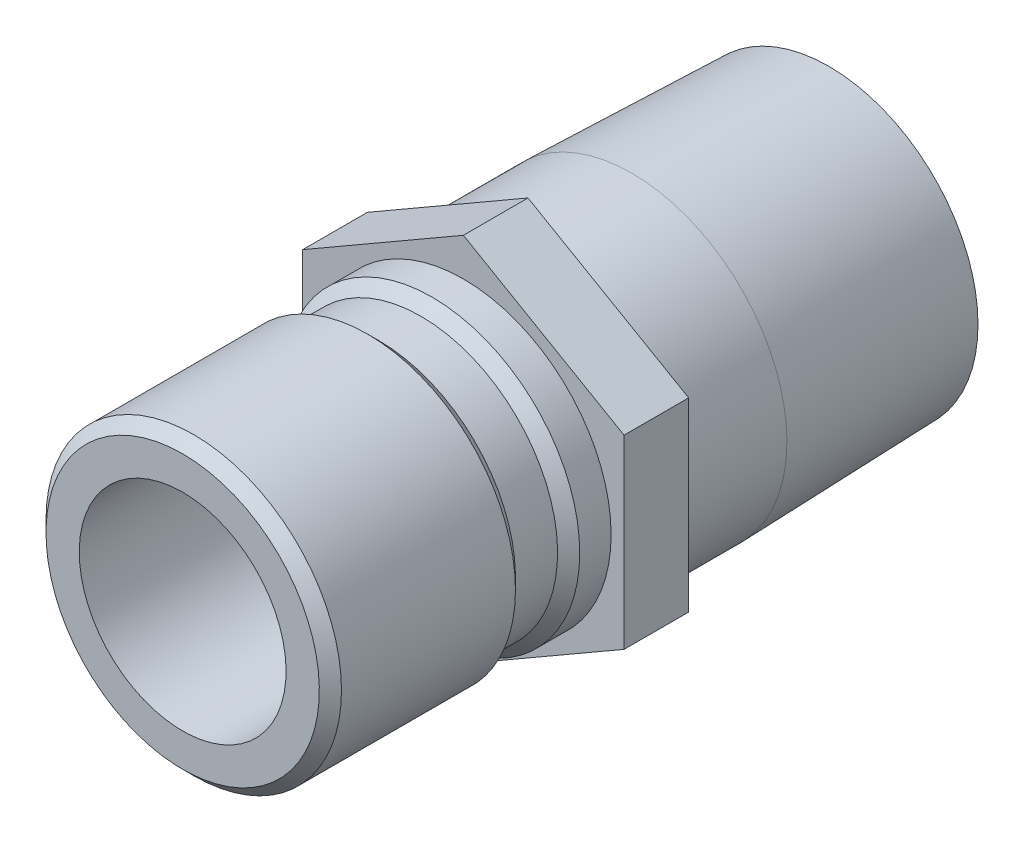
from build123d import *

# Parameters (mm, degrees)
SKETCH2_R           = 7.8994
BOSS_EXTRUDE1_DEPTH = 4.445


with BuildPart() as part:
    # Sketch1 → Revolve1 (revolve)
    with BuildSketch(Plane(origin=(0, 0, 0), x_dir=(0, 0, -1), z_dir=(1, 0, 0))):
        Polygon((-19.304, 7.112), (-19.304, 9.398), (-18.542, 10.16), (-6.5786, 10.16), (-5.8166, 9.398), (-2.921, 9.398), (-2.159, 10.16), (0, 10.16), (0, 10.668), (11.5824, 10.668), (25.146, 10.244140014), (25.146, 7.8994), (-1.105331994, 7.8994), (-1.524, 7.112), align=None)
    revolve(axis=Axis((0, 0, 0), (0, 0, 1)))

    # Sketch2 → Boss-Extrude1 (add)
    with BuildSketch(Plane.XY):
        Polygon((-11.049, 6.379143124), (-11.049, -6.379143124), (0, -12.758286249), (11.049, -6.379143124), (11.049, 6.379143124), (0, 12.758286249), align=None)
        with Locations(Location((0, 0, 0), (0, 0, 90))):
            Circle(SKETCH2_R, mode=Mode.SUBTRACT)
    extrude(amount=-BOSS_EXTRUDE1_DEPTH)


solid = part.part
